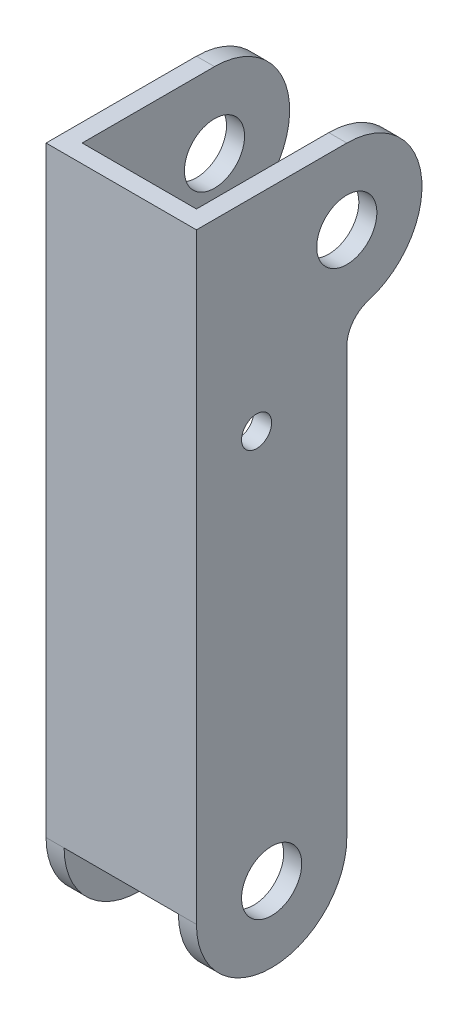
from build123d import *

# Parameters (mm, degrees)
SKETCH1_R           = 10
BOSS_EXTRUDE1_DEPTH = 6
SKETCH6_W           = 50
SKETCH6_H           = 200
BOSS_EXTRUDE5_DEPTH = 6
SKETCH7_R           = 5
CUT_EXTRUDE1_DEPTH  = 90


with BuildPart() as part:
    # Sketch1 → Boss-Extrude1 (new body)
    with BuildSketch(Plane(origin=(0, 0, 0), x_dir=(0, 0, -1), z_dir=(1, 0, 0))):
        with BuildLine():
            Line((25, 0), (25, 141.458980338))
            ThreePointArc((25, 141.458980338), (26.982162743, 147.435123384), (32.142857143, 151.042128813))
            ThreePointArc((32.142857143, 151.042128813), (49.738095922, 178.609239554), (25, 200))
            Line((25, 200), (-25, 200))
            Line((-25, 200), (-25, 0))
            ThreePointArc((-25, 0), (0, -25), (25, 0))
        make_face()
        Circle(SKETCH1_R, mode=Mode.SUBTRACT)
        with Locations((25, 175)):
            Circle(SKETCH1_R, mode=Mode.SUBTRACT)
    boss_extrude1 = extrude(amount=BOSS_EXTRUDE1_DEPTH)

    # Sketch6 → Boss-Extrude5 (add)
    with BuildSketch(Plane.XY.offset(25)):
        with Locations((25, 100)):
            Rectangle(SKETCH6_W, SKETCH6_H)
    extrude(amount=-BOSS_EXTRUDE5_DEPTH)

    # Mirror1: Boss-Extrude1 across plane
    add(boss_extrude1.mirror(Plane.ZY.offset(-25)))

    # Sketch7 → Cut-Extrude1 (cut)
    with BuildSketch(Plane.ZY):
        with Locations((5, 132)):
            Circle(SKETCH7_R)
    extrude(amount=-CUT_EXTRUDE1_DEPTH, mode=Mode.SUBTRACT)


solid = part.part
